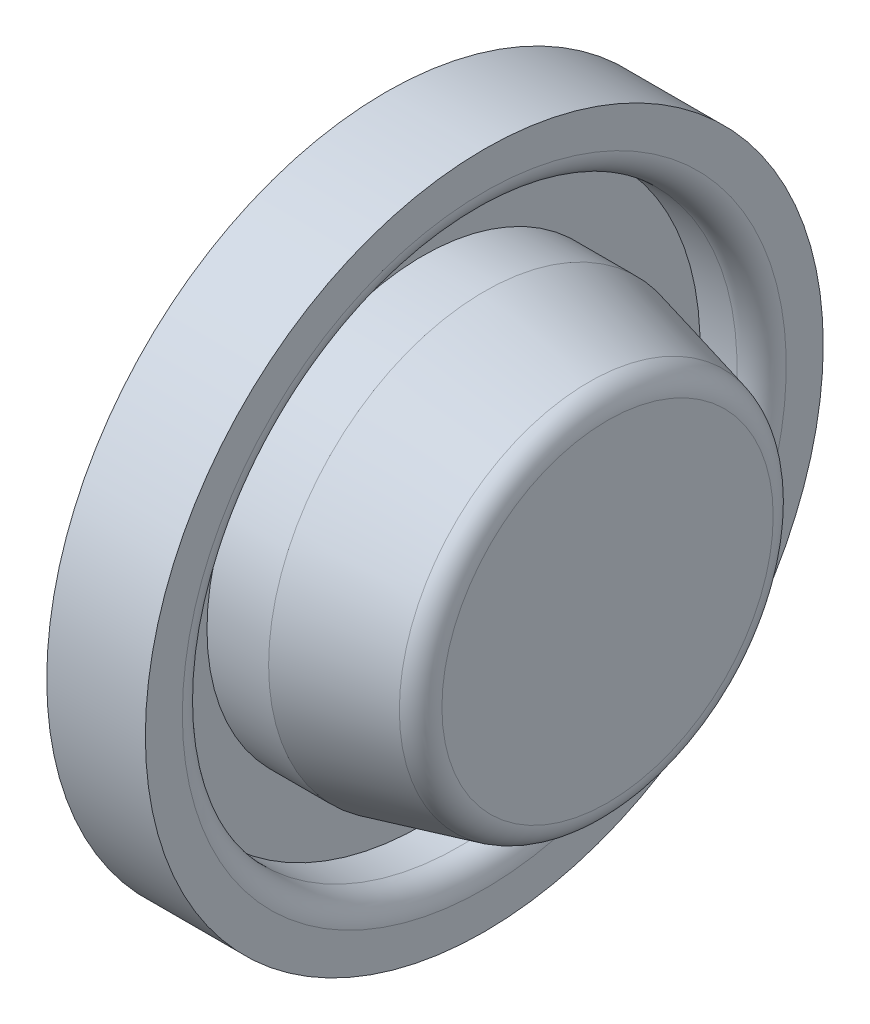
from build123d import *

# Parameters (mm, degrees)
CONG_1_R                = 2
CONG_2_R                = 2
ESQUISSE2_R             = 10
ENL_V_MAT_EXTRU_1_DEPTH = 3
ESQUISSE5_R             = 5.5
ENL_V_MAT_EXTRU_2_DEPTH = 12


with BuildPart() as part:
    # Esquisse1 → R_volution1 (revolve)
    with BuildSketch(Plane.XY, mode=Mode.PRIVATE) as r_volution1_sk:
        Polygon((0, 0), (18, 0), (18, 15), (8, 17.5), (3, 17.5), (3, 22.5), (8, 22.5), (8, 27.5), (0, 27.5), align=None)
    revolve(r_volution1_sk.sketch.rotate(Axis((0, 0, 0), (1, 0, 0)), 90), axis=Axis((0, 0, 0), (1, 0, 0)))

    # Cong_1
    cong_1_edges = [part.edges().sort_by_distance(p)[0] for p in [
        (18, 0, -15),
    ]]
    fillet(cong_1_edges, radius=CONG_1_R)

    # Cong_2
    cong_2_edges = [part.edges().sort_by_distance(p)[0] for p in [
        (8, 0, -22.5),
    ]]
    fillet(cong_2_edges, radius=CONG_2_R)

    # Esquisse2 → Enl_v. mat.-Extru.1 (cut)
    with BuildSketch(Plane.ZY):
        Circle(ESQUISSE2_R)
    extrude(amount=-ENL_V_MAT_EXTRU_1_DEPTH, mode=Mode.SUBTRACT)

    # Esquisse5 → Enl_v. mat.-Extru.2 (cut)
    with BuildSketch(Plane.ZY.offset(-3)):
        Circle(ESQUISSE5_R)
    extrude(amount=-ENL_V_MAT_EXTRU_2_DEPTH, mode=Mode.SUBTRACT)


solid = part.part
